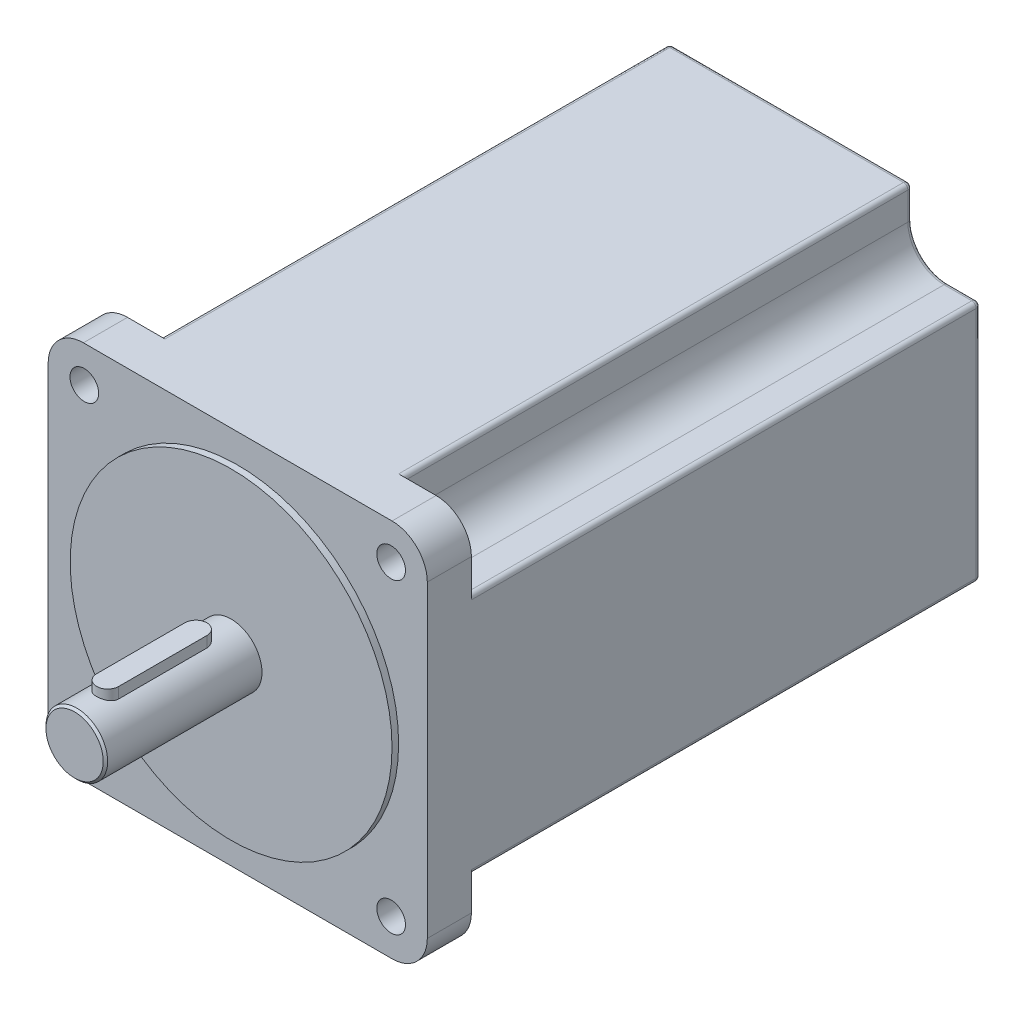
from build123d import *

# Parameters (mm, degrees)
SKETCH_1_R          = 36.5
EXTRUDE_1_DEPTH     = 1.5
SKETCH_2_R          = 7
EXTRUDE_2_DEPTH     = 35.5
SKETCH_4_R          = 3.25
EXTRUDE_3_DEPTH     = 125.5
CUT_EXTRUDE_2_DEPTH = 115.5
CUT_EXTRUDE_3_DEPTH = 3
EXTRUDE_4_DEPTH     = 5
CHAMFER_2_SIZE      = 0.5
FILLET_1_R          = 1


with BuildPart() as part:
    # Sketch 1 → Extrude 1 (new body)
    with BuildSketch(Plane.XY):
        Circle(SKETCH_1_R)
    extrude(amount=-EXTRUDE_1_DEPTH)

    # Sketch 2 → Extrude 2 (add)
    with BuildSketch(Plane.XY):
        Circle(SKETCH_2_R)
    extrude(amount=EXTRUDE_2_DEPTH)

    # Sketch 4 → Extrude 3 (add)
    with BuildSketch(Plane(origin=(0, 0, -1.5), x_dir=(-1, 0, 0), z_dir=(0, 0, -1))):
        with BuildLine():
            Line((0, 43), (35, 43))
            ThreePointArc((35, 43), (40.656854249, 40.656854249), (43, 35))
            Line((43, 35), (43, -35))
            ThreePointArc((43, -35), (40.656854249, -40.656854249), (35, -43))
            Line((35, -43), (-35, -43))
            ThreePointArc((-35, -43), (-40.656854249, -40.656854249), (-43, -35))
            Line((-43, -35), (-43, 35))
            ThreePointArc((-43, 35), (-40.656854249, 40.656854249), (-35, 43))
            Line((-35, 43), (0, 43))
        make_face()
        with Locations((-34.8, 34.8)):
            Circle(SKETCH_4_R, mode=Mode.SUBTRACT)
        with Locations((34.8, 34.8)):
            Circle(SKETCH_4_R, mode=Mode.SUBTRACT)
        with Locations((34.8, -34.8)):
            Circle(SKETCH_4_R, mode=Mode.SUBTRACT)
        with Locations((-34.8, -34.8)):
            Circle(SKETCH_4_R, mode=Mode.SUBTRACT)
    extrude(amount=EXTRUDE_3_DEPTH)

    # Sketch 5 → Cut-Extrude 2 (cut)
    with BuildSketch(Plane(origin=(0, 0, -127), x_dir=(-1, 0, 0), z_dir=(0, 0, -1))):
        with BuildLine():
            Line((13.75, 43), (26.5, 43))
            ThreePointArc((26.5, 43), (27.207106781, 42.707106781), (27.5, 42))
            Line((27.5, 42), (27.5, 35.7))
            ThreePointArc((27.5, 35.7), (29.901724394, 29.901724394), (35.7, 27.5))
            Line((35.7, 27.5), (42, 27.5))
            ThreePointArc((42, 27.5), (42.707106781, 27.207106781), (43, 26.5))
            Line((43, 26.5), (43, 18.140986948))
            Line((43, 18.140986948), (50.571489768, 18.140986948))
            Line((50.571489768, 18.140986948), (50.571489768, 56.827618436))
            Line((50.571489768, 56.827618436), (13.75, 56.827618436))
            Line((13.75, 56.827618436), (13.75, 43))
        make_face()
        with BuildLine():
            Line((-13.75, 56.827618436), (-13.75, 43))
            Line((-13.75, 43), (-26.5, 43))
            ThreePointArc((-26.5, 43), (-27.207106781, 42.707106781), (-27.5, 42))
            Line((-27.5, 42), (-27.5, 35.7))
            ThreePointArc((-27.5, 35.7), (-29.901724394, 29.901724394), (-35.7, 27.5))
            Line((-35.7, 27.5), (-42, 27.5))
            ThreePointArc((-42, 27.5), (-42.707106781, 27.207106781), (-43, 26.5))
            Line((-43, 26.5), (-43, 18.140986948))
            Line((-43, 18.140986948), (-50.571489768, 18.140986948))
            Line((-50.571489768, 18.140986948), (-50.571489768, 56.827618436))
            Line((-50.571489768, 56.827618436), (-13.75, 56.827618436))
        make_face()
        with BuildLine():
            Line((13.75, -56.827618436), (13.75, -43))
            Line((13.75, -43), (26.5, -43))
            ThreePointArc((26.5, -43), (27.207106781, -42.707106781), (27.5, -42))
            Line((27.5, -42), (27.5, -35.7))
            ThreePointArc((27.5, -35.7), (29.901724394, -29.901724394), (35.7, -27.5))
            Line((35.7, -27.5), (42, -27.5))
            ThreePointArc((42, -27.5), (42.707106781, -27.207106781), (43, -26.5))
            Line((43, -26.5), (43, -18.140986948))
            Line((43, -18.140986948), (50.571489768, -18.140986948))
            Line((50.571489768, -18.140986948), (50.571489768, -56.827618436))
            Line((50.571489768, -56.827618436), (13.75, -56.827618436))
        make_face()
        with BuildLine():
            Line((-13.75, -43), (-26.5, -43))
            ThreePointArc((-26.5, -43), (-27.207106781, -42.707106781), (-27.5, -42))
            Line((-27.5, -42), (-27.5, -35.7))
            ThreePointArc((-27.5, -35.7), (-29.901724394, -29.901724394), (-35.7, -27.5))
            Line((-35.7, -27.5), (-42, -27.5))
            ThreePointArc((-42, -27.5), (-42.707106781, -27.207106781), (-43, -26.5))
            Line((-43, -26.5), (-43, -18.140986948))
            Line((-43, -18.140986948), (-50.571489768, -18.140986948))
            Line((-50.571489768, -18.140986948), (-50.571489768, -56.827618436))
            Line((-50.571489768, -56.827618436), (-13.75, -56.827618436))
            Line((-13.75, -56.827618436), (-13.75, -43))
        make_face()
    extrude(amount=-CUT_EXTRUDE_2_DEPTH, mode=Mode.SUBTRACT)

    # Sketch 7 → Cut-Extrude 3 (cut)
    with BuildSketch(Plane(origin=(0, 7, 0), x_dir=(1, 0, 0), z_dir=(0, 1, 0))):
        with BuildLine():
            Line((-2.5, -8), (-2.5, -28))
            ThreePointArc((-2.5, -28), (0, -30.5), (2.5, -28))
            Line((2.5, -28), (2.5, -8))
            ThreePointArc((2.5, -8), (0, -5.5), (-2.5, -8))
        make_face()
    extrude(amount=-CUT_EXTRUDE_3_DEPTH, mode=Mode.SUBTRACT)

    # Chamfer 2
    chamfer_2_edges = [part.edges().sort_by_distance(p)[0] for p in [
        (-7, 0, 35.5),
    ]]
    chamfer(chamfer_2_edges, length=CHAMFER_2_SIZE)

    # Fillet 1
    fillet_1_edges = [part.edges().sort_by_distance(p)[0] for p in [
        (-43, 0, -127),
        (-27.207106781, -42.707106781, -127),
        (-42.707106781, -27.207106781, -127),
        (-38.85, -27.5, -127),
        (-29.901724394, -29.901724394, -127),
        (-27.5, -38.85, -127),
        (0, -43, -127),
        (27.207106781, -42.707106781, -127),
        (27.5, -38.85, -127),
        (29.901724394, -29.901724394, -127),
        (38.85, -27.5, -127),
        (42.707106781, -27.207106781, -127),
        (0, 43, -127),
        (-27.207106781, 42.707106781, -127),
        (-27.5, 38.85, -127),
        (-29.901724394, 29.901724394, -127),
        (-38.85, 27.5, -127),
        (-42.707106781, 27.207106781, -127),
        (43, 0, -127),
        (27.207106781, 42.707106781, -127),
        (42.707106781, 27.207106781, -127),
        (38.85, 27.5, -127),
        (29.901724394, 29.901724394, -127),
        (27.5, 38.85, -127),
    ]]
    fillet(fillet_1_edges, radius=FILLET_1_R)


with BuildPart() as body_2:
    # Sketch 8 → Extrude 4 (new body)
    with BuildSketch(Plane(origin=(0, 4, 0), x_dir=(1, 0, 0), z_dir=(0, 1, 0))):
        with BuildLine():
            Line((-2.5, -28), (-2.5, -8))
            ThreePointArc((-2.5, -8), (0, -5.5), (2.5, -8))
            Line((2.5, -8), (2.5, -28))
            ThreePointArc((2.5, -28), (0, -30.5), (-2.5, -28))
        make_face()
    extrude(amount=EXTRUDE_4_DEPTH)


solid = Compound([part.part, body_2.part])
